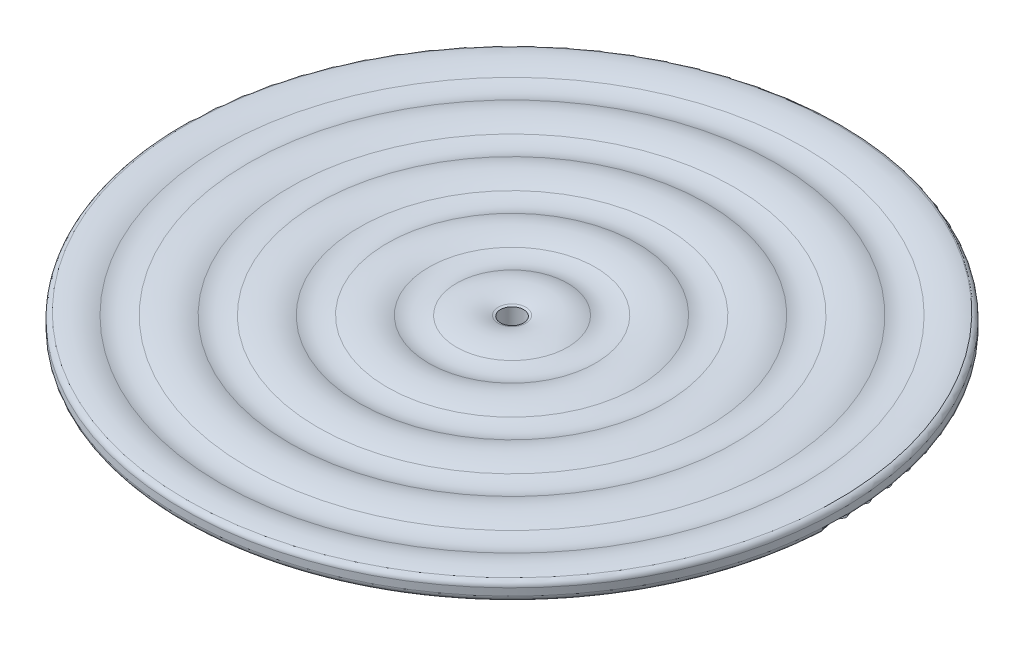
from build123d import *

# Parameters (mm, degrees)
REDONDEO2_R                = 2.5
CORTAR_EXTRUIR2_DEPTH      = 10
CORTAR_EXTRUIR2_DEPTH_BACK = 10
CROQUIS3_R                 = 5


with BuildPart() as part:
    # Croquis1 → Revoluci_n2 (revolve)
    with BuildSketch(Plane.XY, mode=Mode.PRIVATE) as revoluci_n2_sk:
        with BuildLine():
            Line((142.5, 0), (142.5, 4.257530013))
            ThreePointArc((142.5, 4.257530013), (134.20127067, 5.446209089), (126, 3.708099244))
            ThreePointArc((126, 3.708099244), (120, 2.540496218), (114, 3.708099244))
            ThreePointArc((114, 3.708099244), (105, 5.459503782), (96, 3.708099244))
            ThreePointArc((96, 3.708099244), (90, 2.540496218), (84, 3.708099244))
            ThreePointArc((84, 3.708099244), (75, 5.459503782), (66, 3.708099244))
            ThreePointArc((66, 3.708099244), (60, 2.540496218), (54, 3.708099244))
            ThreePointArc((54, 3.708099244), (45, 5.459503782), (36, 3.708099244))
            ThreePointArc((36, 3.708099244), (30, 2.540496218), (24, 3.708099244))
            ThreePointArc((24, 3.708099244), (15, 5.459503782), (6, 3.708099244))
            ThreePointArc((6, 3.708099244), (3.056276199, 2.835109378), (0, 2.540496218))
            Line((0, 2.540496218), (0, -5.459503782))
            ThreePointArc((0, -5.459503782), (4.584414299, -5.017584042), (9, -3.708099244))
            ThreePointArc((9, -3.708099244), (15, -2.540496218), (21, -3.708099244))
            ThreePointArc((21, -3.708099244), (30, -5.459503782), (39, -3.708099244))
            ThreePointArc((39, -3.708099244), (45, -2.540496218), (51, -3.708099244))
            ThreePointArc((51, -3.708099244), (60, -5.459503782), (69, -3.708099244))
            ThreePointArc((69, -3.708099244), (75, -2.540496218), (81, -3.708099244))
            ThreePointArc((81, -3.708099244), (90, -5.459503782), (99, -3.708099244))
            ThreePointArc((99, -3.708099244), (105, -2.540496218), (111, -3.708099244))
            ThreePointArc((111, -3.708099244), (120, -5.459503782), (129, -3.708099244))
            ThreePointArc((129, -3.708099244), (135.827457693, -2.561906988), (142.5, -4.407202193))
            Line((142.5, -4.407202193), (142.5, 0))
        make_face()
    revolve(revoluci_n2_sk.sketch.rotate(Axis((0, 13.278696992, 0), (0, -1, 0)), 90), axis=Axis((0, 13.278696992, 0), (0, -1, 0)))

    # Redondeo2
    redondeo2_edges = [part.edges().sort_by_distance(p)[0] for p in [
        (0, -4.407202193, -142.5),
        (0, 4.257530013, -142.5),
    ]]
    fillet(redondeo2_edges, radius=REDONDEO2_R)

    # Croquis3 → Cortar-Extruir2 (cut, two sides: drawn at the far end of the back side and taken through both)
    with BuildSketch(Plane(origin=(0, 0, 0), x_dir=(1, 0, 0), z_dir=(0, 1, 0)).offset(-CORTAR_EXTRUIR2_DEPTH_BACK)):
        Circle(CROQUIS3_R)
    extrude(amount=CORTAR_EXTRUIR2_DEPTH + CORTAR_EXTRUIR2_DEPTH_BACK, mode=Mode.SUBTRACT)


solid = part.part
